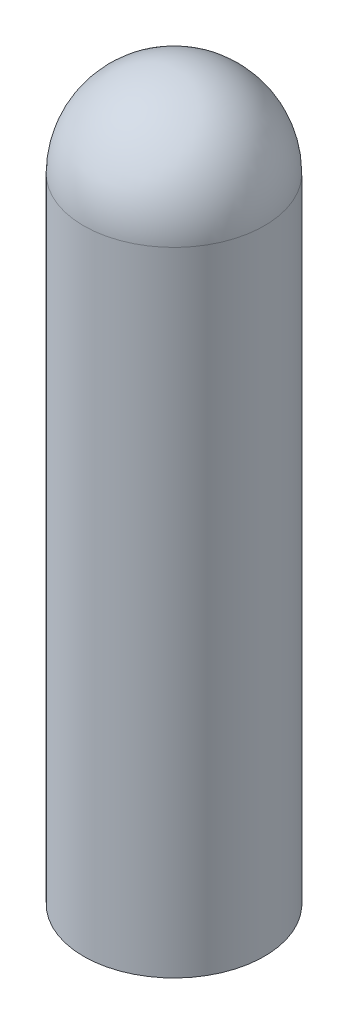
ISO-10303-21;
HEADER;
FILE_DESCRIPTION(('STEP AP214'),'2;1');
FILE_NAME('part.step','',(''),(''),'','','');
FILE_SCHEMA(('AUTOMOTIVE_DESIGN { 1 0 10303 214 1 1 1 1 }'));
ENDSEC;
DATA;
#1=APPLICATION_CONTEXT('core data for automotive mechanical design processes');
#2=APPLICATION_PROTOCOL_DEFINITION('international standard','automotive_design',2000,#1);
#3=PRODUCT_CONTEXT('',#1,'mechanical');
#4=PRODUCT('Part','Part','',(#3));
#5=PRODUCT_RELATED_PRODUCT_CATEGORY('part','',(#4));
#6=PRODUCT_DEFINITION_FORMATION('','',#4);
#7=PRODUCT_DEFINITION_CONTEXT('part definition',#1,'design');
#8=PRODUCT_DEFINITION('design','',#6,#7);
#9=PRODUCT_DEFINITION_SHAPE('','',#8);
#10=(LENGTH_UNIT() NAMED_UNIT(*) SI_UNIT(.MILLI.,.METRE.));
#11=(NAMED_UNIT(*) PLANE_ANGLE_UNIT() SI_UNIT($,.RADIAN.));
#12=(NAMED_UNIT(*) SI_UNIT($,.STERADIAN.) SOLID_ANGLE_UNIT());
#13=UNCERTAINTY_MEASURE_WITH_UNIT(LENGTH_MEASURE(1.E-05),#10,'distance_accuracy_value','');
#14=(GEOMETRIC_REPRESENTATION_CONTEXT(3) GLOBAL_UNCERTAINTY_ASSIGNED_CONTEXT((#13)) GLOBAL_UNIT_ASSIGNED_CONTEXT((#10,
#11,#12)) REPRESENTATION_CONTEXT('',''));
#15=CARTESIAN_POINT('',(0.,0.,0.));
#16=DIRECTION('',(0.,0.,1.));
#17=DIRECTION('',(1.,0.,0.));
#18=AXIS2_PLACEMENT_3D('',#15,#16,#17);
#19=CARTESIAN_POINT('',(0.,40.,0.));
#20=DIRECTION('',(0.,-1.,0.));
#21=DIRECTION('',(0.,0.,-1.));
#22=AXIS2_PLACEMENT_3D('',#19,#20,#21);
#23=CYLINDRICAL_SURFACE('',#22,5.);
#24=CARTESIAN_POINT('',(0.,35.,0.));
#25=DIRECTION('',(0.,-1.,0.));
#26=DIRECTION('',(0.,0.,-1.));
#27=AXIS2_PLACEMENT_3D('',#24,#25,#26);
#28=CIRCLE('',#27,5.);
#29=CARTESIAN_POINT('',(0.,35.,-5.));
#30=VERTEX_POINT('',#29);
#31=EDGE_CURVE('E11',#30,#30,#28,.T.);
#32=ORIENTED_EDGE('',*,*,#31,.T.);
#33=EDGE_LOOP('',(#32));
#34=FACE_BOUND('',#33,.T.);
#35=CARTESIAN_POINT('',(0.,0.,0.));
#36=DIRECTION('',(0.,1.,0.));
#37=DIRECTION('',(0.,0.,1.));
#38=AXIS2_PLACEMENT_3D('',#35,#36,#37);
#39=CIRCLE('',#38,5.);
#40=CARTESIAN_POINT('',(0.,0.,5.));
#41=VERTEX_POINT('',#40);
#42=EDGE_CURVE('E45',#41,#41,#39,.T.);
#43=ORIENTED_EDGE('',*,*,#42,.T.);
#44=EDGE_LOOP('',(#43));
#45=FACE_BOUND('',#44,.T.);
#46=ADVANCED_FACE('F38',(#34,#45),#23,.T.);
#47=CARTESIAN_POINT('',(0.,0.,0.));
#48=DIRECTION('',(0.,1.,0.));
#49=DIRECTION('',(0.,0.,1.));
#50=AXIS2_PLACEMENT_3D('',#47,#48,#49);
#51=PLANE('',#50);
#52=CARTESIAN_POINT('',(0.,0.,0.));
#53=DIRECTION('',(0.,-1.,0.));
#54=DIRECTION('',(0.,0.,-1.));
#55=AXIS2_PLACEMENT_3D('',#52,#53,#54);
#56=CIRCLE('',#55,2.01929999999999);
#57=CARTESIAN_POINT('',(0.,0.,-2.01929999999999));
#58=VERTEX_POINT('',#57);
#59=EDGE_CURVE('E57',#58,#58,#56,.T.);
#60=ORIENTED_EDGE('',*,*,#59,.F.);
#61=EDGE_LOOP('',(#60));
#62=FACE_BOUND('',#61,.T.);
#63=ORIENTED_EDGE('',*,*,#42,.F.);
#64=EDGE_LOOP('',(#63));
#65=FACE_BOUND('',#64,.T.);
#66=ADVANCED_FACE('F65',(#62,#65),#51,.F.);
#67=CARTESIAN_POINT('',(0.,35.,0.));
#68=DIRECTION('',(0.,1.,0.));
#69=DIRECTION('',(0.,0.,1.));
#70=AXIS2_PLACEMENT_3D('',#67,#68,#69);
#71=SPHERICAL_SURFACE('',#70,5.);
#72=ORIENTED_EDGE('',*,*,#31,.F.);
#73=EDGE_LOOP('',(#72));
#74=FACE_BOUND('',#73,.T.);
#75=ADVANCED_FACE('F40',(#74),#71,.T.);
#76=CARTESIAN_POINT('',(0.,35.,0.));
#77=DIRECTION('',(0.,-1.,0.));
#78=DIRECTION('',(0.,0.,-1.));
#79=AXIS2_PLACEMENT_3D('',#76,#77,#78);
#80=CONICAL_SURFACE('',#79,2.01929999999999,1.02974425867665);
#81=CARTESIAN_POINT('',(0.,36.2133178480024,0.));
#82=VERTEX_POINT('',#81);
#83=VERTEX_LOOP('',#82);
#84=FACE_BOUND('',#83,.T.);
#85=CARTESIAN_POINT('',(0.,35.,0.));
#86=DIRECTION('',(0.,-1.,0.));
#87=DIRECTION('',(0.,0.,-1.));
#88=AXIS2_PLACEMENT_3D('',#85,#86,#87);
#89=CIRCLE('',#88,2.01929999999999);
#90=CARTESIAN_POINT('',(0.,35.,-2.01929999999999));
#91=VERTEX_POINT('',#90);
#92=EDGE_CURVE('E55',#91,#91,#89,.T.);
#93=ORIENTED_EDGE('',*,*,#92,.T.);
#94=EDGE_LOOP('',(#93));
#95=FACE_BOUND('',#94,.T.);
#96=ADVANCED_FACE('F48',(#84,#95),#80,.F.);
#97=CARTESIAN_POINT('',(0.,0.,0.));
#98=DIRECTION('',(0.,-1.,0.));
#99=DIRECTION('',(0.,0.,-1.));
#100=AXIS2_PLACEMENT_3D('',#97,#98,#99);
#101=CYLINDRICAL_SURFACE('',#100,2.01929999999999);
#102=ORIENTED_EDGE('',*,*,#92,.F.);
#103=EDGE_LOOP('',(#102));
#104=FACE_BOUND('',#103,.T.);
#105=ORIENTED_EDGE('',*,*,#59,.T.);
#106=EDGE_LOOP('',(#105));
#107=FACE_BOUND('',#106,.T.);
#108=ADVANCED_FACE('F51',(#104,#107),#101,.F.);
#109=CLOSED_SHELL('',(#46,#66,#75,#96,#108));
#110=MANIFOLD_SOLID_BREP('B2',#109);
#111=ADVANCED_BREP_SHAPE_REPRESENTATION('',(#18,#110),#14);
#112=SHAPE_DEFINITION_REPRESENTATION(#9,#111);
ENDSEC;
END-ISO-10303-21;
